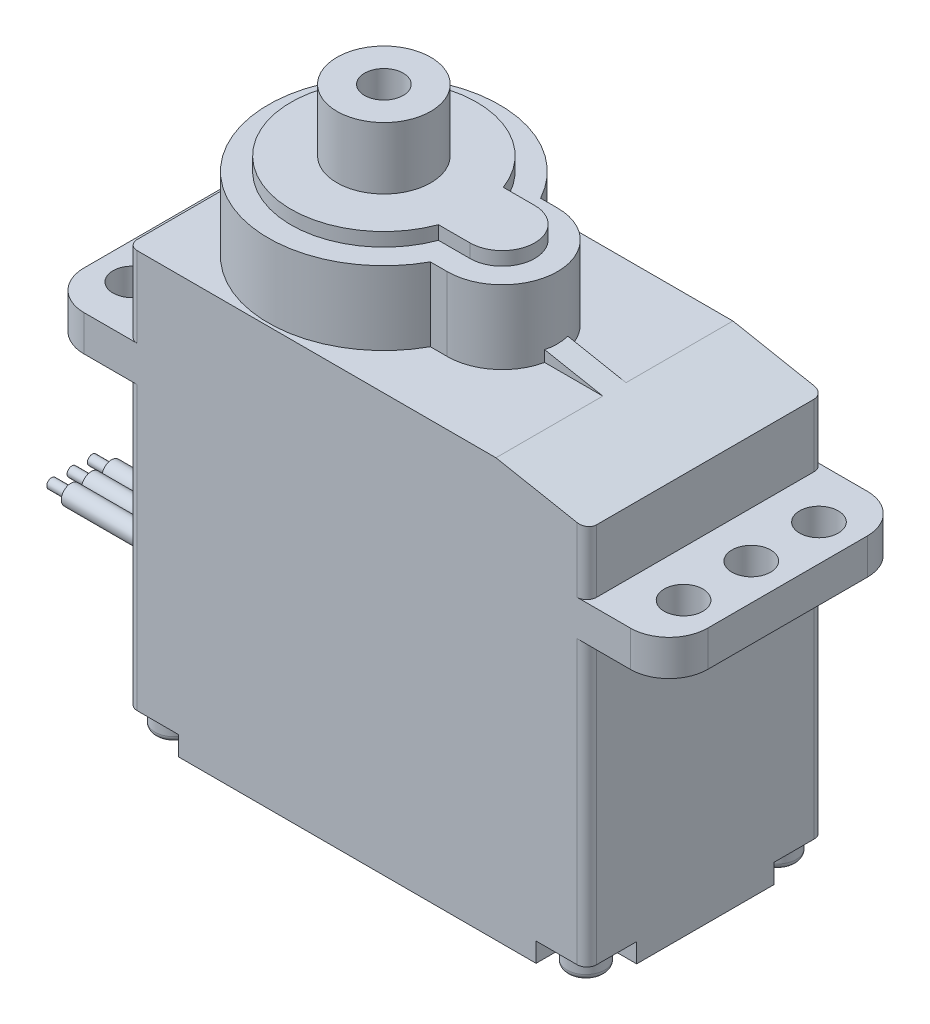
from build123d import *

# Parameters (mm, degrees)
BOSS_EXTRUDE1_DEPTH = 6.125
BOSS_EXTRUDE2_DEPTH = 3.8
BOSS_EXTRUDE3_DEPTH = 0.7
SKETCH4_R           = 1
CUT_EXTRUDE1_DEPTH  = 27.766257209
SKETCH5_R           = 0.975
CUT_EXTRUDE2_DEPTH  = 1
SKETCH6_R           = 0.5
BOSS_EXTRUDE4_DEPTH = 8
SKETCH7_R           = 0.25
BOSS_EXTRUDE5_DEPTH = 1
BOSS_EXTRUDE6_DEPTH = 0.6
SKETCH9_W           = 1.425
SKETCH9_H           = 3.2
FILLET1_R           = 0.3
FILLET2_R           = 2
FILLET3_R           = 0.5


with BuildPart() as part:
    # Sketch1 → Boss-Extrude1 (new, symmetric)
    with BuildSketch(Plane.XY):
        Polygon((-7.13, 6), (11.92, 6), (16.62, 5.1), (16.62, 1.85), (20.87, 1.85), (20.87, 0), (16.62, 0), (16.62, -15.6), (-7.13, -15.6), (-7.13, 0), (-11.38, 0), (-11.38, 1.85), (-7.13, 1.85), align=None)
    extrude(amount=BOSS_EXTRUDE1_DEPTH, both=True)

    # Sketch2 → Boss-Extrude2 (add)
    with BuildSketch(Plane(origin=(0, 6, 0), x_dir=(1, 0, 0), z_dir=(0, 1, 0))):
        with BuildLine():
            Line((5.251487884, -2.85), (6.125, -2.85))
            ThreePointArc((6.125, -2.85), (8.975, 0), (6.125, 2.85))
            Line((6.125, 2.85), (5.251487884, 2.85))
            ThreePointArc((5.251487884, 2.85), (-5.975, 0), (5.251487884, -2.85))
        make_face()
    extrude(amount=BOSS_EXTRUDE2_DEPTH)

    # Sketch3 → Boss-Extrude3 (add)
    with BuildSketch(Plane(origin=(0, 9.8, 0), x_dir=(1, 0, 0), z_dir=(0, 1, 0))):
        with BuildLine():
            Line((4.498263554, -1.675), (6.125, -1.675))
            ThreePointArc((6.125, -1.675), (7.8, 0), (6.125, 1.675))
            Line((6.125, 1.675), (4.498263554, 1.675))
            ThreePointArc((4.498263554, 1.675), (-4.8, 0), (4.498263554, -1.675))
        make_face()
    extrude(amount=BOSS_EXTRUDE3_DEPTH)

    # Sketch4 → Cut-Extrude1 (cut, through all)
    with BuildSketch(Plane(origin=(0, 0, 0), x_dir=(1, 0, 0), z_dir=(0, 1, 0))):
        with Locations(Location((-9.505, 3.5, 0), (0, 0, 90))):
            Circle(SKETCH4_R)
        with Locations(Location((-9.505, -3.5, 0), (0, 0, 90))):
            Circle(SKETCH4_R)
        with Locations(Location((18.995, 3.5, 0), (0, 0, 90))):
            Circle(SKETCH4_R)
        with Locations(Location((18.995, -3.5, 0), (0, 0, 90))):
            Circle(SKETCH4_R)
        with Locations(Location((18.995, 0, 0), (0, 0, 90))):
            Circle(SKETCH4_R)
        with Locations(Location((-9.505, 0, 0), (0, 0, 90))):
            Circle(SKETCH4_R)
    extrude(amount=CUT_EXTRUDE1_DEPTH, mode=Mode.SUBTRACT)

    # Sketch5 → Cut-Extrude2 (cut)
    # profile 1 of 4: a face of its own
    with BuildSketch(Plane.XZ.offset(15.6)):
        with BuildLine():
            Line((16.62, 6.125), (13.995, 6.125))
            Line((13.995, 6.125), (13.995, 4.85))
            ThreePointArc((13.995, 4.85), (14.375761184, 3.930761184), (15.295, 3.55))
            Line((15.295, 3.55), (16.62, 3.55))
            Line((16.62, 3.55), (16.62, 6.125))
        make_face()
        with Locations(Location((15.395, 4.95, 0), (0, 0, 270))):
            Circle(SKETCH5_R, mode=Mode.SUBTRACT)
    # profile 2 of 4: a face of its own
    with BuildSketch(Plane.XZ.offset(15.6)):
        with BuildLine():
            Line((16.62, -6.125), (13.995, -6.125))
            Line((13.995, -6.125), (13.995, -4.85))
            ThreePointArc((13.995, -4.85), (14.375761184, -3.930761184), (15.295, -3.55))
            Line((15.295, -3.55), (16.62, -3.55))
            Line((16.62, -3.55), (16.62, -6.125))
        make_face()
        with Locations(Location((15.395, -4.95, 0), (0, 0, 270))):
            Circle(SKETCH5_R, mode=Mode.SUBTRACT)
    # profile 3 of 4: a face of its own
    with BuildSketch(Plane.XZ.offset(15.6)):
        with BuildLine():
            Line((-7.13, 6.125), (-4.505, 6.125))
            Line((-4.505, 6.125), (-4.505, 4.85))
            ThreePointArc((-4.505, 4.85), (-4.885761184, 3.930761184), (-5.805, 3.55))
            Line((-5.805, 3.55), (-7.13, 3.55))
            Line((-7.13, 3.55), (-7.13, 6.125))
        make_face()
        with Locations(Location((-5.905, 4.95, 0), (0, 0, 270))):
            Circle(SKETCH5_R, mode=Mode.SUBTRACT)
    # profile 4 of 4: a face of its own
    with BuildSketch(Plane.XZ.offset(15.6)):
        with BuildLine():
            Line((-7.13, -6.125), (-4.505, -6.125))
            Line((-4.505, -6.125), (-4.505, -4.85))
            ThreePointArc((-4.505, -4.85), (-4.885761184, -3.930761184), (-5.805, -3.55))
            Line((-5.805, -3.55), (-7.13, -3.55))
            Line((-7.13, -3.55), (-7.13, -6.125))
        make_face()
        with Locations(Location((-5.905, -4.95, 0), (0, 0, 270))):
            Circle(SKETCH5_R, mode=Mode.SUBTRACT)
    extrude(amount=-CUT_EXTRUDE2_DEPTH, mode=Mode.SUBTRACT)

    # Sketch6 → Boss-Extrude4 (add)
    with BuildSketch(Plane.ZY.offset(7.13)):
        with Locations(Location((0, -11.7, 0), (0, 0, 90))):
            Circle(SKETCH6_R)
        with Locations(Location((1.05, -11.7, 0), (0, 0, 90))):
            Circle(SKETCH6_R)
        with Locations(Location((-1.05, -11.7, 0), (0, 0, 90))):
            Circle(SKETCH6_R)
    extrude(amount=BOSS_EXTRUDE4_DEPTH)

    # Sketch7 → Boss-Extrude5 (add)
    with BuildSketch(Plane.ZY.offset(15.13)):
        with Locations(Location((0, -11.7, 0), (0, 0, 270))):
            Circle(SKETCH7_R)
        with Locations(Location((1.05, -11.7, 0), (0, 0, 270))):
            Circle(SKETCH7_R)
        with Locations(Location((-1.05, -11.7, 0), (0, 0, 270))):
            Circle(SKETCH7_R)
    extrude(amount=BOSS_EXTRUDE5_DEPTH)

    # Sketch8 → Boss-Extrude6 (add, symmetric)
    with BuildSketch(Plane.XY):
        Polygon((11.92, 6), (7.8, 6.78893617), (7.8, 6), align=None)
    extrude(amount=BOSS_EXTRUDE6_DEPTH, both=True)

    # Sketch9 → Revolve1 (revolve)
    with BuildSketch(Plane.XY, mode=Mode.PRIVATE) as revolve1_sk:
        with Locations((1.7125, 12.1)):
            Rectangle(SKETCH9_W, SKETCH9_H)
    revolve(revolve1_sk.sketch.rotate(Axis((0, 55, 0), (0, -1, 0)), 90), axis=Axis((0, 55, 0), (0, -1, 0)))

    # Fillet1
    fillet1_edges = [part.edges().sort_by_distance(p)[0] for p in [
        (15.395, -15.6, -3.975),
        (-5.905, -15.6, 5.925),
        (-5.905, -15.6, -3.975),
        (15.395, -15.6, 5.925),
    ]]
    fillet(fillet1_edges, radius=FILLET1_R)

    # Fillet2
    fillet2_edges = [part.edges().sort_by_distance(p)[0] for p in [
        (-11.38, 0.925, 6.125),
        (20.87, 0.925, -6.125),
        (-11.38, 0.925, -6.125),
        (20.87, 0.925, 6.125),
    ]]
    fillet(fillet2_edges, radius=FILLET2_R)

    # Fillet3
    fillet3_edges = [part.edges().sort_by_distance(p)[0] for p in [
        (16.62, -7.3, -6.125),
        (16.62, 3.475, -6.125),
        (-7.13, -7.3, -6.125),
        (-7.13, -7.3, 6.125),
        (-7.13, 3.925, -6.125),
        (16.62, 3.475, 6.125),
        (-7.13, 3.925, 6.125),
        (16.62, -7.3, 6.125),
    ]]
    fillet(fillet3_edges, radius=FILLET3_R)


solid = part.part
